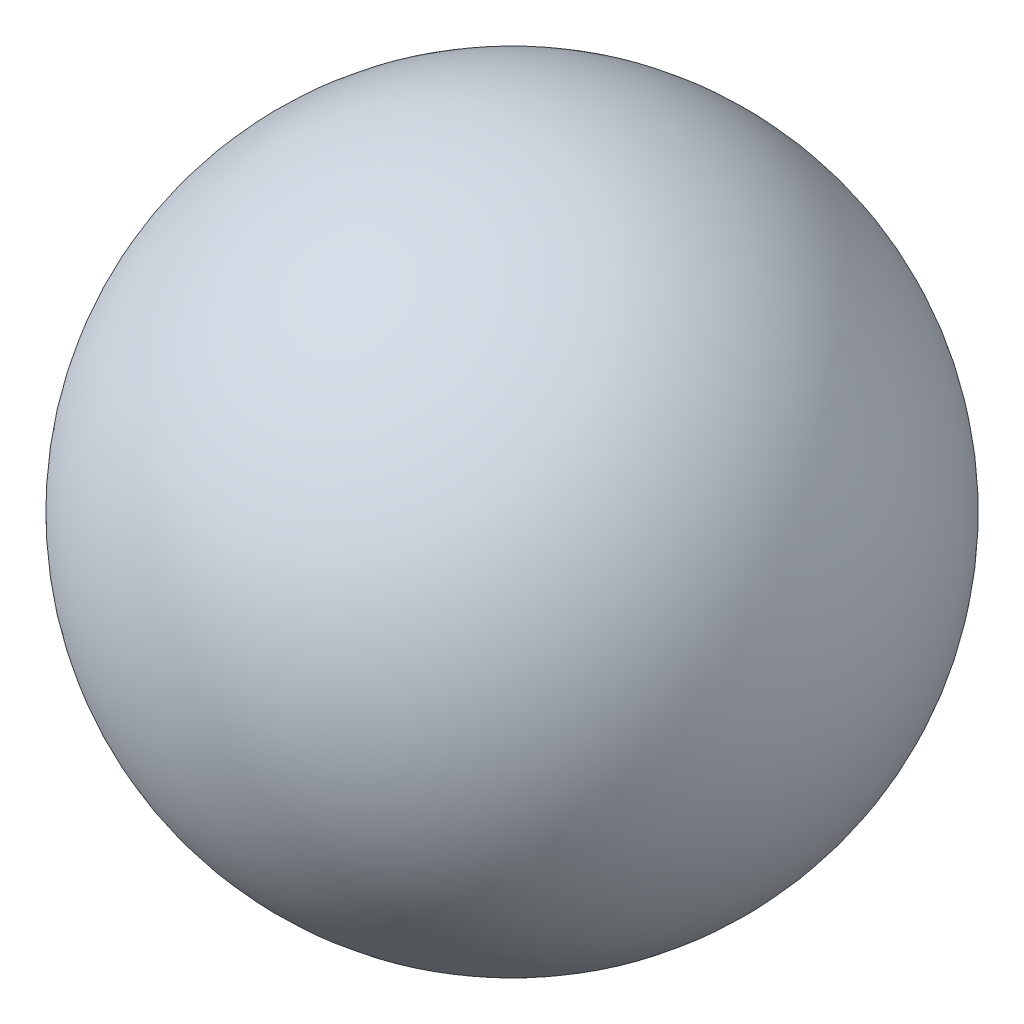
from build123d import *


with BuildPart() as part:
    # Skica1 → Rotovat3 (revolve)
    with BuildSketch(Plane.XY):
        with BuildLine():
            Line((0, 3.969), (0, -3.969))
            ThreePointArc((0, -3.969), (3.969, 0), (0, 3.969))
        make_face()
    revolve(axis=Axis((0, 3.969, 0), (0, -1, 0)))


solid = part.part
